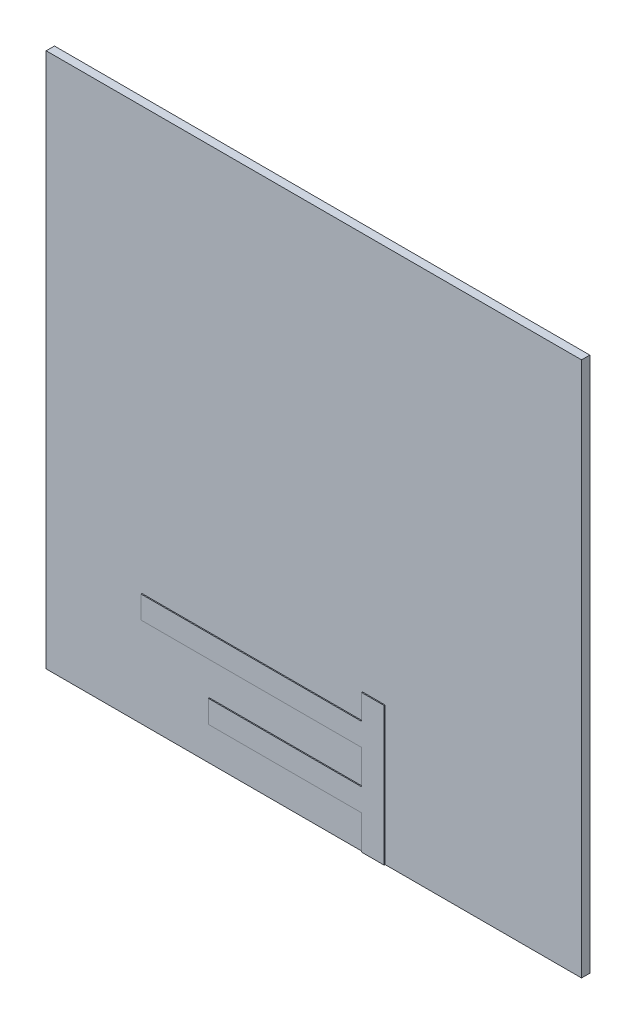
from build123d import *

# Parameters (mm, degrees)
CROQUIS1_W              = 110
CROQUIS1_H              = 110
SALIENTE_EXTRUIR1_DEPTH = 1.9
CORTAR_EXTRUIR1_DEPTH   = 0.2


with BuildPart() as part:
    # Croquis1 → Saliente-Extruir1 (new body)
    with BuildSketch(Plane.XY):
        Rectangle(CROQUIS1_W, CROQUIS1_H)
    extrude(amount=SALIENTE_EXTRUIR1_DEPTH)

    # Croquis9 → Cortar-Extruir1 (cut)
    with BuildSketch(Plane.XY.offset(1.9)):
        Polygon((10, -55), (-55, -55), (-55, 55), (55, 55), (55, -55), (14.63, -55), (14.63, -26.596107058), (10, -26.596107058), (10, -31.735), (-35.33, -31.735), (-35.33, -36.365), (10, -36.365), (10, -43.375), (-21.48, -43.375), (-21.48, -48.005), (10, -48.005), align=None)
    extrude(amount=-CORTAR_EXTRUIR1_DEPTH, mode=Mode.SUBTRACT)


solid = part.part
